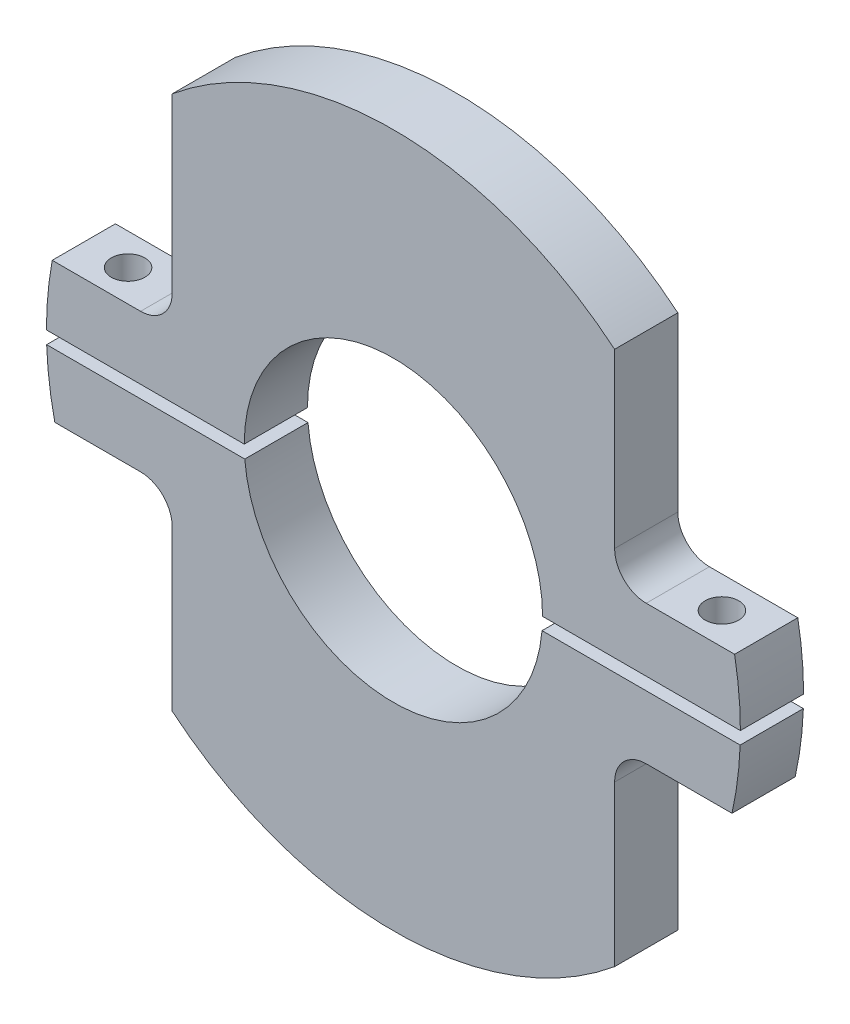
from build123d import *

# Parameters (mm, degrees)
SKETCH1_R          = 69.723
SKETCH1_R_2        = 29.972
EXTRUDE1_DEPTH     = 12.7
CUT_EXTRUDE1_DEPTH = 12.7
SKETCH3_R          = 3.3782
CUT_EXTRUDE2_DEPTH = 109.702059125


with BuildPart() as part:
    # Sketch1 → Extrude1 (new body)
    with BuildSketch(Plane.XY):
        Circle(SKETCH1_R)
        Circle(SKETCH1_R_2, mode=Mode.SUBTRACT)
    extrude(amount=EXTRUDE1_DEPTH)

    # Sketch2 → Cut-Extrude1 (cut)
    with BuildSketch(Plane.XY.offset(12.7)):
        with BuildLine():
            Line((-79.262411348, 0), (-79.262411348, 12.7))
            Line((-79.262411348, 12.7), (-50.8, 12.7))
            ThreePointArc((-50.8, 12.7), (-46.309871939, 14.559871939), (-44.45, 19.05))
            Line((-44.45, 19.05), (-44.45, 73.813494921))
            Line((-44.45, 73.813494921), (-107.724851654, 73.813494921))
            Line((-107.724851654, 73.813494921), (-107.724851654, -54.692863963))
            Line((-107.724851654, -54.692863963), (-44.45, -54.692863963))
            Line((-44.45, -54.692863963), (-44.45, -21.59))
            ThreePointArc((-44.45, -21.59), (-46.309871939, -17.099871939), (-50.8, -15.24))
            Line((-50.8, -15.24), (-79.262411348, -15.24))
            Line((-79.262411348, -15.24), (-79.262411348, -2.54))
            Line((-79.262411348, -2.54), (89.995862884, -2.54))
            Line((89.995862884, -2.54), (89.995862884, -15.24))
            Line((89.995862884, -15.24), (50.8, -15.24))
            ThreePointArc((50.8, -15.24), (46.309871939, -17.099871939), (44.45, -21.59))
            Line((44.45, -21.59), (44.45, -54.692863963))
            Line((44.45, -54.692863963), (103.463918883, -54.692863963))
            Line((103.463918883, -54.692863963), (103.463918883, 59.500134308))
            Line((103.463918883, 59.500134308), (44.45, 59.500134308))
            Line((44.45, 59.500134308), (44.45, 19.05))
            ThreePointArc((44.45, 19.05), (46.309871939, 14.559871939), (50.8, 12.7))
            Line((50.8, 12.7), (89.995862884, 12.7))
            Line((89.995862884, 12.7), (89.995862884, 0))
            Line((89.995862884, 0), (-79.262411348, 0))
        make_face()
    extrude(amount=-CUT_EXTRUDE1_DEPTH, mode=Mode.SUBTRACT)


with BuildPart() as cut_extrude1_piece_1:
    # of the separate pieces the step leaves, piece 1, a body of its own (cut_extrude1_pieces)
    add(part.part.solids().sort_by_distance((69.723, 0, 0))[0])


with BuildPart() as cut_extrude1_piece_2:
    # of the separate pieces the step leaves, piece 2, a body of its own (cut_extrude1_pieces)
    add(part.part.solids().sort_by_distance((69.676718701, -2.54, 12.7))[0])


with BuildPart() as cut_extrude2_tool:
    # Sketch3 → Cut-Extrude2 (new, through all)
    with BuildSketch(Plane(origin=(0, 12.7, 0), x_dir=(-1, 0, 0), z_dir=(0, 1, 0))):
        with Locations(Location((59.66659508, 6.35, 0), (0, 0, 90))):
            Circle(SKETCH3_R)
        with Locations(Location((-59.66659508, 6.35, 0), (0, 0, 90))):
            Circle(SKETCH3_R)
    extrude(amount=-CUT_EXTRUDE2_DEPTH)


with BuildPart() as cut_extrude1_piece_1_1:
    add(cut_extrude1_piece_1.part)

    # Cut-Extrude2: cut by cut_extrude2_tool
    add(cut_extrude2_tool.part, mode=Mode.SUBTRACT)


with BuildPart() as cut_extrude1_piece_2_1:
    add(cut_extrude1_piece_2.part)

    # Cut-Extrude2: cut by cut_extrude2_tool
    add(cut_extrude2_tool.part, mode=Mode.SUBTRACT)


solid = Compound([cut_extrude1_piece_1_1.part, cut_extrude1_piece_2_1.part])
